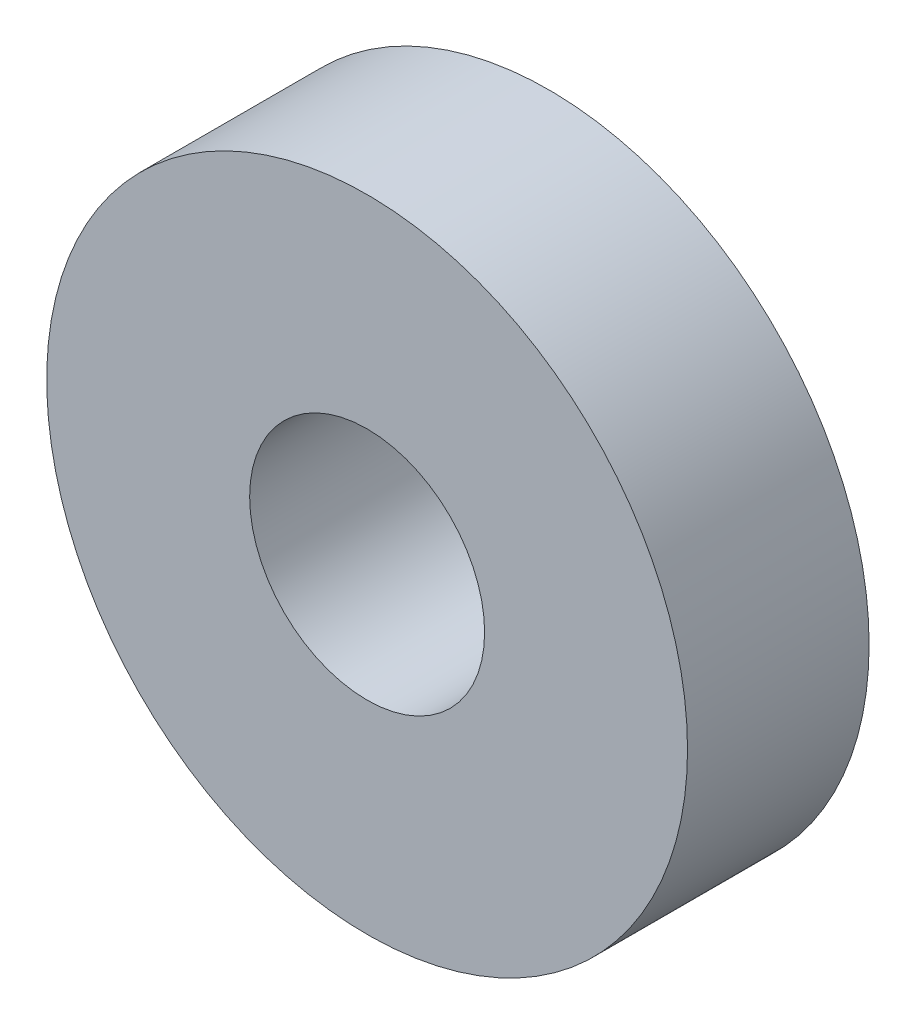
ISO-10303-21;
HEADER;
FILE_DESCRIPTION(('STEP AP214'),'2;1');
FILE_NAME('part.step','',(''),(''),'','','');
FILE_SCHEMA(('AUTOMOTIVE_DESIGN { 1 0 10303 214 1 1 1 1 }'));
ENDSEC;
DATA;
#1=APPLICATION_CONTEXT('core data for automotive mechanical design processes');
#2=APPLICATION_PROTOCOL_DEFINITION('international standard','automotive_design',2000,#1);
#3=PRODUCT_CONTEXT('',#1,'mechanical');
#4=PRODUCT('Part','Part','',(#3));
#5=PRODUCT_RELATED_PRODUCT_CATEGORY('part','',(#4));
#6=PRODUCT_DEFINITION_FORMATION('','',#4);
#7=PRODUCT_DEFINITION_CONTEXT('part definition',#1,'design');
#8=PRODUCT_DEFINITION('design','',#6,#7);
#9=PRODUCT_DEFINITION_SHAPE('','',#8);
#10=(LENGTH_UNIT() NAMED_UNIT(*) SI_UNIT(.MILLI.,.METRE.));
#11=(NAMED_UNIT(*) PLANE_ANGLE_UNIT() SI_UNIT($,.RADIAN.));
#12=(NAMED_UNIT(*) SI_UNIT($,.STERADIAN.) SOLID_ANGLE_UNIT());
#13=UNCERTAINTY_MEASURE_WITH_UNIT(LENGTH_MEASURE(1.E-05),#10,'distance_accuracy_value','');
#14=(GEOMETRIC_REPRESENTATION_CONTEXT(3) GLOBAL_UNCERTAINTY_ASSIGNED_CONTEXT((#13)) GLOBAL_UNIT_ASSIGNED_CONTEXT((#10,
#11,#12)) REPRESENTATION_CONTEXT('',''));
#15=CARTESIAN_POINT('',(0.,0.,0.));
#16=DIRECTION('',(0.,0.,1.));
#17=DIRECTION('',(1.,0.,0.));
#18=AXIS2_PLACEMENT_3D('',#15,#16,#17);
#19=CARTESIAN_POINT('',(0.,0.,1.7));
#20=DIRECTION('',(0.,0.,1.));
#21=DIRECTION('',(1.,0.,0.));
#22=AXIS2_PLACEMENT_3D('',#19,#20,#21);
#23=PLANE('',#22);
#24=CARTESIAN_POINT('',(0.,0.,1.7));
#25=DIRECTION('',(0.,0.,1.));
#26=DIRECTION('',(1.,0.,0.));
#27=AXIS2_PLACEMENT_3D('',#24,#25,#26);
#28=CIRCLE('',#27,3.);
#29=CARTESIAN_POINT('',(3.,0.,1.7));
#30=VERTEX_POINT('',#29);
#31=EDGE_CURVE('E10',#30,#30,#28,.T.);
#32=ORIENTED_EDGE('',*,*,#31,.T.);
#33=EDGE_LOOP('',(#32));
#34=FACE_BOUND('',#33,.T.);
#35=CARTESIAN_POINT('',(0.,0.,1.7));
#36=DIRECTION('',(0.,0.,1.));
#37=DIRECTION('',(1.,0.,0.));
#38=AXIS2_PLACEMENT_3D('',#35,#36,#37);
#39=CIRCLE('',#38,1.1);
#40=CARTESIAN_POINT('',(1.1,0.,1.7));
#41=VERTEX_POINT('',#40);
#42=EDGE_CURVE('E35',#41,#41,#39,.T.);
#43=ORIENTED_EDGE('',*,*,#42,.F.);
#44=EDGE_LOOP('',(#43));
#45=FACE_BOUND('',#44,.T.);
#46=ADVANCED_FACE('F24',(#34,#45),#23,.T.);
#47=CARTESIAN_POINT('',(0.,0.,0.));
#48=DIRECTION('',(0.,0.,1.));
#49=DIRECTION('',(1.,0.,0.));
#50=AXIS2_PLACEMENT_3D('',#47,#48,#49);
#51=PLANE('',#50);
#52=CARTESIAN_POINT('',(0.,0.,0.));
#53=DIRECTION('',(0.,0.,1.));
#54=DIRECTION('',(1.,0.,0.));
#55=AXIS2_PLACEMENT_3D('',#52,#53,#54);
#56=CIRCLE('',#55,3.);
#57=CARTESIAN_POINT('',(3.,0.,0.));
#58=VERTEX_POINT('',#57);
#59=EDGE_CURVE('E31',#58,#58,#56,.T.);
#60=ORIENTED_EDGE('',*,*,#59,.F.);
#61=EDGE_LOOP('',(#60));
#62=FACE_BOUND('',#61,.T.);
#63=CARTESIAN_POINT('',(0.,0.,0.));
#64=DIRECTION('',(0.,0.,1.));
#65=DIRECTION('',(1.,0.,0.));
#66=AXIS2_PLACEMENT_3D('',#63,#64,#65);
#67=CIRCLE('',#66,1.1);
#68=CARTESIAN_POINT('',(1.1,0.,0.));
#69=VERTEX_POINT('',#68);
#70=EDGE_CURVE('E39',#69,#69,#67,.T.);
#71=ORIENTED_EDGE('',*,*,#70,.T.);
#72=EDGE_LOOP('',(#71));
#73=FACE_BOUND('',#72,.T.);
#74=ADVANCED_FACE('F45',(#62,#73),#51,.F.);
#75=CARTESIAN_POINT('',(0.,0.,1.7));
#76=DIRECTION('',(0.,0.,-1.));
#77=DIRECTION('',(-1.,0.,0.));
#78=AXIS2_PLACEMENT_3D('',#75,#76,#77);
#79=CYLINDRICAL_SURFACE('',#78,3.);
#80=ORIENTED_EDGE('',*,*,#31,.F.);
#81=EDGE_LOOP('',(#80));
#82=FACE_BOUND('',#81,.T.);
#83=ORIENTED_EDGE('',*,*,#59,.T.);
#84=EDGE_LOOP('',(#83));
#85=FACE_BOUND('',#84,.T.);
#86=ADVANCED_FACE('F26',(#82,#85),#79,.T.);
#87=CARTESIAN_POINT('',(0.,0.,1.7));
#88=DIRECTION('',(0.,0.,-1.));
#89=DIRECTION('',(-1.,0.,0.));
#90=AXIS2_PLACEMENT_3D('',#87,#88,#89);
#91=CYLINDRICAL_SURFACE('',#90,1.1);
#92=ORIENTED_EDGE('',*,*,#42,.T.);
#93=EDGE_LOOP('',(#92));
#94=FACE_BOUND('',#93,.T.);
#95=ORIENTED_EDGE('',*,*,#70,.F.);
#96=EDGE_LOOP('',(#95));
#97=FACE_BOUND('',#96,.T.);
#98=ADVANCED_FACE('F47',(#94,#97),#91,.F.);
#99=CLOSED_SHELL('',(#46,#74,#86,#98));
#100=MANIFOLD_SOLID_BREP('B2',#99);
#101=ADVANCED_BREP_SHAPE_REPRESENTATION('',(#18,#100),#14);
#102=SHAPE_DEFINITION_REPRESENTATION(#9,#101);
ENDSEC;
END-ISO-10303-21;
